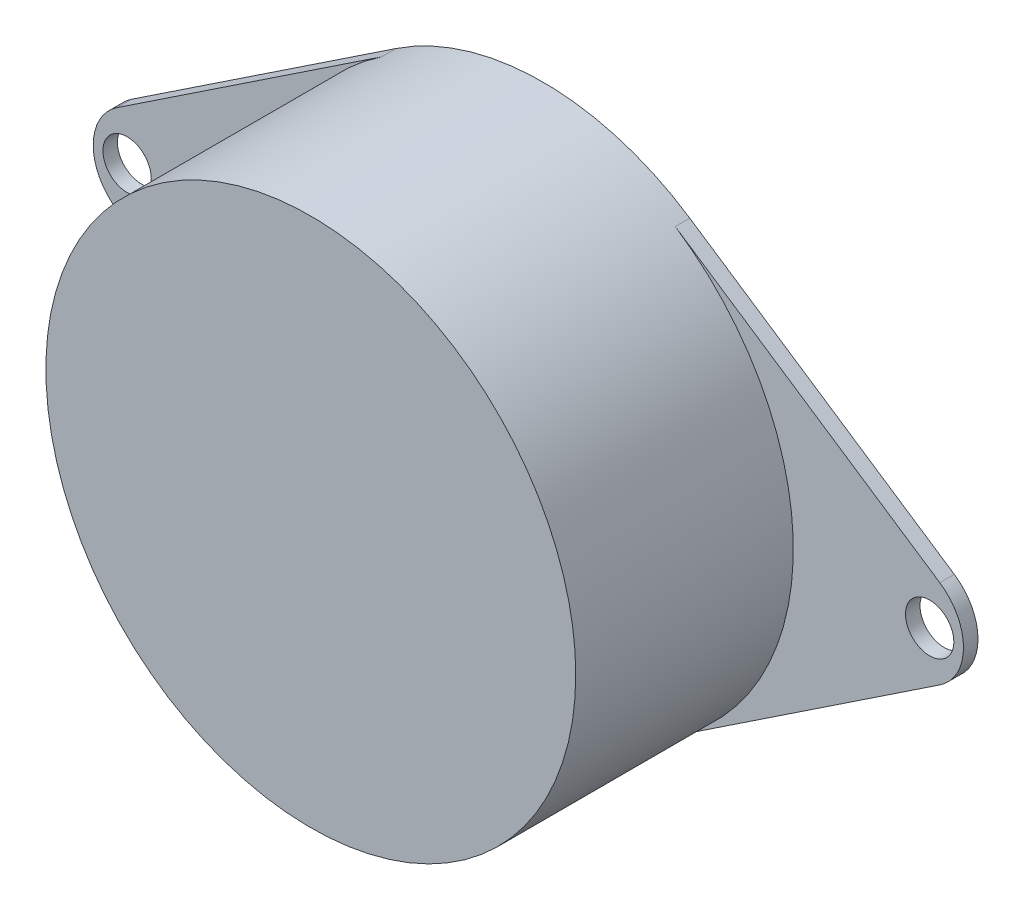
from build123d import *

# Parameters (mm, degrees)
EXTRUSION1_DEPTH        = 1.5
ESQUISSE2_R             = 27.4
EXTRUSION2_DEPTH        = 22.5
ESQUISSE3_R             = 2.5
ENL_V_MAT_EXTRU_1_DEPTH = 22.5
ESQUISSE4_R             = 2.5
ENL_V_MAT_EXTRU_2_DEPTH = 22.5
ESQUISSE6_R             = 5.4
ESQUISSE6_R_2           = 3.25
EXTRUSION3_DEPTH        = 2


with BuildPart() as part:
    # Esquisse1 → Extrusion1 (new body)
    with BuildSketch(Plane.XY):
        with BuildLine():
            Line((-42.549367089, 4.577265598), (-15.191392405, 22.803104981))
            ThreePointArc((-15.191392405, 22.803104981), (0, 27.4), (15.191392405, 22.803104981))
            Line((15.191392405, 22.803104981), (42.549367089, 4.577265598))
            ThreePointArc((42.549367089, 4.577265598), (45, 0), (42.549367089, -4.577265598))
            Line((42.549367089, -4.577265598), (15.191392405, -22.803104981))
            ThreePointArc((15.191392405, -22.803104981), (0, -27.4), (-15.191392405, -22.803104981))
            Line((-15.191392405, -22.803104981), (-42.549367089, -4.577265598))
            ThreePointArc((-42.549367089, -4.577265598), (-45, 0), (-42.549367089, 4.577265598))
        make_face()
    extrude(amount=EXTRUSION1_DEPTH)

    # Esquisse2 → Extrusion2 (add)
    with BuildSketch(Plane.XY.offset(1.5)):
        with Locations(Location((0, 0, 0), (0, 0, 123.671489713))):
            Circle(ESQUISSE2_R)
    extrude(amount=EXTRUSION2_DEPTH)

    # Esquisse3 → Enl_v. mat.-Extru.1 (cut)
    with BuildSketch(Plane.XY.offset(1.5)):
        with Locations((41.5, 0)):
            Circle(ESQUISSE3_R)
    extrude(amount=-ENL_V_MAT_EXTRU_1_DEPTH, mode=Mode.SUBTRACT)

    # Esquisse4 → Enl_v. mat.-Extru.2 (cut)
    with BuildSketch(Plane.XY.offset(1.5)):
        with Locations((-41.5, 0)):
            Circle(ESQUISSE4_R)
    extrude(amount=-ENL_V_MAT_EXTRU_2_DEPTH, mode=Mode.SUBTRACT)

    # Esquisse6 → Extrusion3 (add)
    with BuildSketch(Plane(origin=(0, 0, 0), x_dir=(-1, 0, 0), z_dir=(0, 0, -1))):
        with Locations(Location((0, 0, 0), (0, 0, 180))):
            Circle(ESQUISSE6_R)
        Circle(ESQUISSE6_R_2, mode=Mode.SUBTRACT)
    extrude(amount=EXTRUSION3_DEPTH)


solid = part.part
